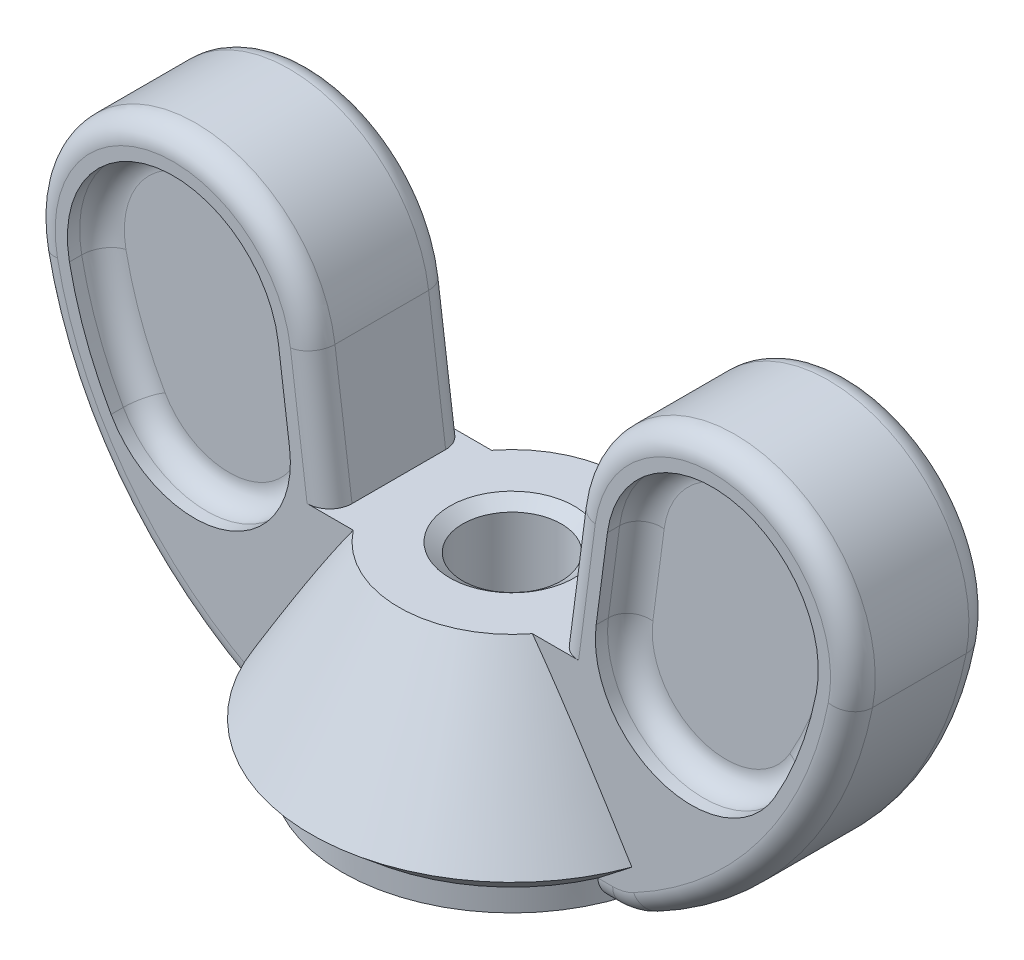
from build123d import *

# Parameters (mm, degrees)
WING_DEPTH        = 1.397
BOSSHOLESKE_W     = 0.99695
BOSSHOLESKE_H     = 4.064
WINGINDENT1_START = 0.6985
WINGINDENT1_DEPTH = 13.289807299
WINGFILLET_R      = 0.451555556


with BuildPart() as part:
    # WingSke → Wing (new, symmetric)
    with BuildSketch(Plane.XY):
        with BuildLine():
            Line((-2.286, 4.064), (2.286, 4.064))
            Line((2.286, 4.064), (2.630001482, 6.67695067))
            ThreePointArc((2.630001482, 6.67695067), (5.90506877, 9.106145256), (8.226121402, 5.753569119))
            ThreePointArc((8.226121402, 5.753569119), (6.775660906, 2.486748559), (4.064, 0.158047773))
            ThreePointArc((4.064, 0.158047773), (3.756186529, 0.040105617), (3.429, 0))
            Line((3.429, 0), (-3.429, 0))
            ThreePointArc((-3.429, 0), (-3.756186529, 0.040105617), (-4.064, 0.158047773))
            ThreePointArc((-4.064, 0.158047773), (-6.775660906, 2.486748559), (-8.226121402, 5.753569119))
            ThreePointArc((-8.226121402, 5.753569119), (-5.90506877, 9.106145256), (-2.630001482, 6.67695067))
            Line((-2.630001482, 6.67695067), (-2.286, 4.064))
        make_face()
    extrude(amount=WING_DEPTH, both=True)

    # BossSke → Boss (revolve)
    with BuildSketch(Plane.XY):
        Polygon((-2.286, 4.064), (-4.064, 0.984383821), (-3.429, 0.451555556), (-3.429, 0), (0, 0), (0, 4.064), align=None)
    revolve(axis=Axis((0, 0, 0), (0, 1, 0)))

    # BossHoleSke → BossHole (revolve, cut)
    with BuildSketch(Plane.XY, mode=Mode.PRIVATE) as bosshole_sk:
        with Locations((0.498475, 2.032)):
            Rectangle(BOSSHOLESKE_W, BOSSHOLESKE_H)
    revolve(bosshole_sk.sketch.rotate(Axis((0, 4.064, 0), (0, 1, 0)), 90), axis=Axis((0, 4.064, 0), (0, 1, 0)), mode=Mode.SUBTRACT)

    # Sketch7 → Cut-Revolve2 (revolve, cut)
    with BuildSketch(Plane.XY, mode=Mode.PRIVATE) as cut_revolve2_sk:
        Polygon((0.99695, 3.881700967), (1.2573, 4.064), (0.99695, 4.064), align=None)
        Polygon((0.99695, 0.182299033), (0.99695, 0), (1.2573, 0), align=None)
    revolve(cut_revolve2_sk.sketch.rotate(Axis((0, 62.750365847, 0), (0, -1, 0)), 180), axis=Axis((0, 62.750365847, 0), (0, -1, 0)), mode=Mode.SUBTRACT)

    # Sketch10 → WingIndent1 (cut, through all)
    with BuildSketch(Plane.XY.offset(WINGINDENT1_START)):
        with BuildLine():
            Line((-3.322525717, 6.585778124), (-3.09537787, 4.860418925))
            ThreePointArc((-3.09537787, 4.860418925), (-4.397289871, 2.770427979), (-6.699747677, 3.643196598))
            ThreePointArc((-6.699747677, 3.643196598), (-7.211651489, 4.732275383), (-7.541017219, 5.88971062))
            ThreePointArc((-7.541017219, 5.88971062), (-5.79135121, 8.416964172), (-3.322525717, 6.585778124))
        make_face()
        with BuildLine():
            Line((3.322525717, 6.585778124), (3.09537787, 4.860418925))
            ThreePointArc((3.09537787, 4.860418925), (4.397289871, 2.770427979), (6.699747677, 3.643196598))
            ThreePointArc((6.699747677, 3.643196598), (7.211651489, 4.732275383), (7.541017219, 5.88971062))
            ThreePointArc((7.541017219, 5.88971062), (5.79135121, 8.416964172), (3.322525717, 6.585778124))
        make_face()
    wingindent1 = extrude(amount=WINGINDENT1_DEPTH, mode=Mode.SUBTRACT)

    # Mirror1: WingIndent1 across plane
    add(wingindent1.mirror(Plane.XY), mode=Mode.SUBTRACT)

    # WingFillet
    wingfillet_edges = [part.edges().sort_by_distance(p)[0] for p in [
        (3.280261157, 0, -1.397),
        (3.756186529, 0.040105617, -1.397),
        (6.775660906, 2.486748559, -1.397),
        (5.90506877, 9.106145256, -1.397),
        (-3.280261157, 0, -1.397),
        (-3.756186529, 0.040105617, -1.397),
        (-6.775660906, 2.486748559, -1.397),
        (-5.90506877, 9.106145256, -1.397),
        (3.280261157, 0, 1.397),
        (3.756186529, 0.040105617, 1.397),
        (6.775660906, 2.486748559, 1.397),
        (5.90506877, 9.106145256, 1.397),
        (-3.280261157, 0, 1.397),
        (-3.756186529, 0.040105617, 1.397),
        (-6.775660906, 2.486748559, 1.397),
        (-5.90506877, 9.106145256, 1.397),
        (2.458000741, 5.370475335, -1.397),
        (-2.458000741, 5.370475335, -1.397),
        (2.458000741, 5.370475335, 1.397),
        (-2.458000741, 5.370475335, 1.397),
        (3.208951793, 5.723098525, -0.6985),
        (5.79135121, 8.416964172, -0.6985),
        (7.211651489, 4.732275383, -0.6985),
        (-5.79135121, 8.416964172, -0.6985),
        (-3.208951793, 5.723098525, -0.6985),
        (-4.397289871, 2.770427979, -0.6985),
        (-5.79135121, 8.416964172, 0.6985),
        (-3.208951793, 5.723098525, 0.6985),
        (-4.397289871, 2.770427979, 0.6985),
        (3.208951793, 5.723098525, 0.6985),
        (5.79135121, 8.416964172, 0.6985),
        (7.211651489, 4.732275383, 0.6985),
        (4.397289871, 2.770427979, -0.6985),
        (-7.211651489, 4.732275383, -0.6985),
        (-7.211651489, 4.732275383, 0.6985),
        (4.397289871, 2.770427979, 0.6985),
    ]]
    fillet(wingfillet_edges, radius=WINGFILLET_R)


solid = part.part
